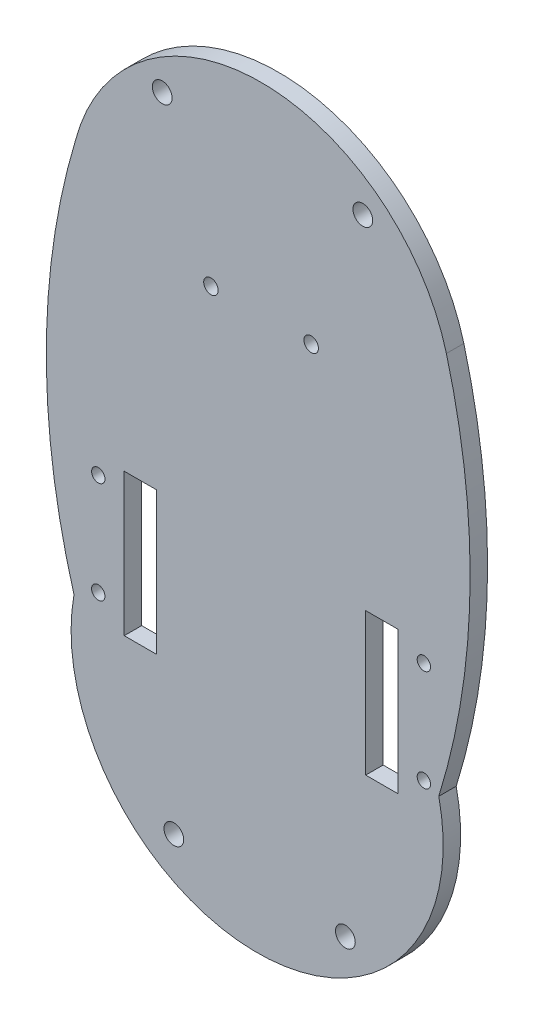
from build123d import *

# Parameters (mm, degrees)
SKETCH1_R           = 1.7
SKETCH1_R_2         = 1.15
BOSS_EXTRUDE1_DEPTH = 3
SKETCH2_W           = 5.534114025
SKETCH2_H           = 24.5
SKETCH2_W_2         = 5.53
CUT_EXTRUDE1_DEPTH  = 10
SKETCH3_R           = 1.25
CUT_EXTRUDE2_DEPTH  = 10


with BuildPart() as part:
    # Sketch1 → Boss-Extrude1 (new body)
    with BuildSketch(Plane.XY):
        with BuildLine():
            ThreePointArc((-31.877009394, -24.46441144), (0, 0), (31.877009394, -24.46441144))
            ThreePointArc((31.877009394, -24.46441144), (35.937387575, -57.863683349), (30.56627446, -91.07737298))
            ThreePointArc((30.56627446, -91.07737298), (0, -130), (-32.179310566, -92.4))
            ThreePointArc((-32.179310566, -92.4), (-36.936121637, -58.410366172), (-31.877009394, -24.46441144))
        make_face()
        with Locations((17.5, -11)):
            Circle(SKETCH1_R, mode=Mode.SUBTRACT)
        with Locations((14.5, -120)):
            Circle(SKETCH1_R, mode=Mode.SUBTRACT)
        with Locations((28, -72.54)):
            Circle(SKETCH1_R_2, mode=Mode.SUBTRACT)
        with Locations((28, -90)):
            Circle(SKETCH1_R_2, mode=Mode.SUBTRACT)
        with Locations(Location((-28, -90, 0), (0, 0, 180))):
            Circle(SKETCH1_R_2, mode=Mode.SUBTRACT)
        with Locations(Location((-28, -72.54, 0), (0, 0, 180))):
            Circle(SKETCH1_R_2, mode=Mode.SUBTRACT)
        with Locations((-15, -119.5)):
            Circle(SKETCH1_R, mode=Mode.SUBTRACT)
        with Locations((-17, -10)):
            Circle(SKETCH1_R, mode=Mode.SUBTRACT)
    extrude(amount=BOSS_EXTRUDE1_DEPTH)

    # Sketch2 → Cut-Extrude1 (cut)
    with BuildSketch(Plane.XY.offset(3)):
        with Locations((-20.767057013, -81.9575504)):
            Rectangle(SKETCH2_W, SKETCH2_H)
        with Locations((20.765, -81.9575504)):
            Rectangle(SKETCH2_W_2, SKETCH2_H)
    extrude(amount=-CUT_EXTRUDE1_DEPTH, mode=Mode.SUBTRACT)

    # Sketch3 → Cut-Extrude2 (cut)
    with BuildSketch(Plane.XY.offset(3)):
        with Locations((-8.62, -34.7075504)):
            Circle(SKETCH3_R)
        with Locations((8.62, -34.7075504)):
            Circle(SKETCH3_R)
    extrude(amount=-CUT_EXTRUDE2_DEPTH, mode=Mode.SUBTRACT)


solid = part.part
